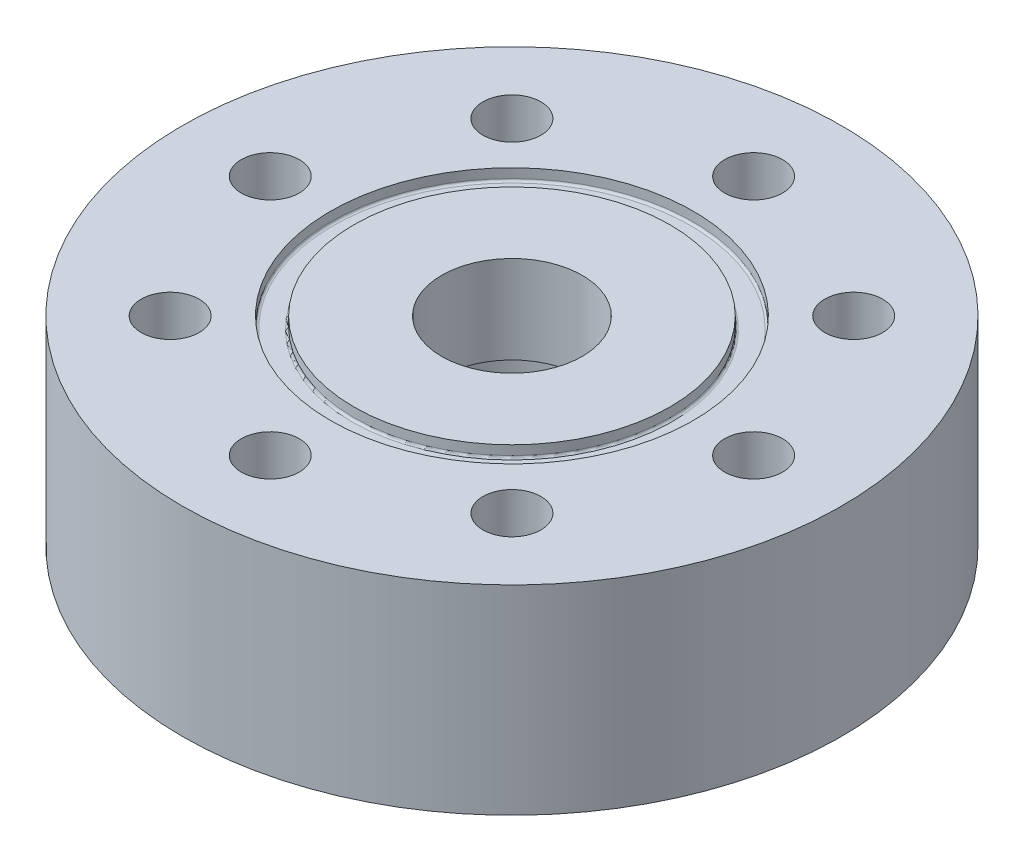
ISO-10303-21;
HEADER;
FILE_DESCRIPTION(('STEP AP214'),'2;1');
FILE_NAME('part.step','',(''),(''),'','','');
FILE_SCHEMA(('AUTOMOTIVE_DESIGN { 1 0 10303 214 1 1 1 1 }'));
ENDSEC;
DATA;
#1=APPLICATION_CONTEXT('core data for automotive mechanical design processes');
#2=APPLICATION_PROTOCOL_DEFINITION('international standard','automotive_design',2000,#1);
#3=PRODUCT_CONTEXT('',#1,'mechanical');
#4=PRODUCT('Part','Part','',(#3));
#5=PRODUCT_RELATED_PRODUCT_CATEGORY('part','',(#4));
#6=PRODUCT_DEFINITION_FORMATION('','',#4);
#7=PRODUCT_DEFINITION_CONTEXT('part definition',#1,'design');
#8=PRODUCT_DEFINITION('design','',#6,#7);
#9=PRODUCT_DEFINITION_SHAPE('','',#8);
#10=(LENGTH_UNIT() NAMED_UNIT(*) SI_UNIT(.MILLI.,.METRE.));
#11=(NAMED_UNIT(*) PLANE_ANGLE_UNIT() SI_UNIT($,.RADIAN.));
#12=(NAMED_UNIT(*) SI_UNIT($,.STERADIAN.) SOLID_ANGLE_UNIT());
#13=UNCERTAINTY_MEASURE_WITH_UNIT(LENGTH_MEASURE(1.E-05),#10,'distance_accuracy_value','');
#14=(GEOMETRIC_REPRESENTATION_CONTEXT(3) GLOBAL_UNCERTAINTY_ASSIGNED_CONTEXT((#13)) GLOBAL_UNIT_ASSIGNED_CONTEXT((#10,
#11,#12)) REPRESENTATION_CONTEXT('',''));
#15=CARTESIAN_POINT('',(0.,0.,0.));
#16=DIRECTION('',(0.,0.,1.));
#17=DIRECTION('',(1.,0.,0.));
#18=AXIS2_PLACEMENT_3D('',#15,#16,#17);
#19=CARTESIAN_POINT('',(0.,22.7,0.));
#20=DIRECTION('',(0.,-1.,0.));
#21=DIRECTION('',(0.,0.,-1.));
#22=AXIS2_PLACEMENT_3D('',#19,#20,#21);
#23=CYLINDRICAL_SURFACE('',#22,37.5);
#24=CARTESIAN_POINT('',(0.,22.7,0.));
#25=DIRECTION('',(0.,1.,0.));
#26=DIRECTION('',(0.,0.,1.));
#27=AXIS2_PLACEMENT_3D('',#24,#25,#26);
#28=CIRCLE('',#27,37.5);
#29=CARTESIAN_POINT('',(0.,22.7,37.5));
#30=VERTEX_POINT('',#29);
#31=EDGE_CURVE('E60',#30,#30,#28,.T.);
#32=ORIENTED_EDGE('',*,*,#31,.F.);
#33=EDGE_LOOP('',(#32));
#34=FACE_BOUND('',#33,.T.);
#35=CARTESIAN_POINT('',(0.,0.,0.));
#36=DIRECTION('',(0.,1.,0.));
#37=DIRECTION('',(0.,0.,1.));
#38=AXIS2_PLACEMENT_3D('',#35,#36,#37);
#39=CIRCLE('',#38,37.5);
#40=CARTESIAN_POINT('',(0.,0.,37.5));
#41=VERTEX_POINT('',#40);
#42=EDGE_CURVE('E61',#41,#41,#39,.T.);
#43=ORIENTED_EDGE('',*,*,#42,.T.);
#44=EDGE_LOOP('',(#43));
#45=FACE_BOUND('',#44,.T.);
#46=ADVANCED_FACE('F36',(#34,#45),#23,.T.);
#47=CARTESIAN_POINT('',(0.,22.7,0.));
#48=DIRECTION('',(0.,1.,0.));
#49=DIRECTION('',(0.,0.,1.));
#50=AXIS2_PLACEMENT_3D('',#47,#48,#49);
#51=PLANE('',#50);
#52=CARTESIAN_POINT('',(0.,22.7,0.));
#53=DIRECTION('',(0.,1.,0.));
#54=DIRECTION('',(0.,0.,1.));
#55=AXIS2_PLACEMENT_3D('',#52,#53,#54);
#56=CIRCLE('',#55,20.6375);
#57=CARTESIAN_POINT('',(0.,22.7,20.6375));
#58=VERTEX_POINT('',#57);
#59=EDGE_CURVE('E82',#58,#58,#56,.T.);
#60=ORIENTED_EDGE('',*,*,#59,.F.);
#61=EDGE_LOOP('',(#60));
#62=FACE_BOUND('',#61,.T.);
#63=CARTESIAN_POINT('',(-27.5,22.7,0.));
#64=DIRECTION('',(0.,-1.,0.));
#65=DIRECTION('',(0.,0.,-1.));
#66=AXIS2_PLACEMENT_3D('',#63,#64,#65);
#67=CIRCLE('',#66,3.3);
#68=CARTESIAN_POINT('',(-27.5,22.7,-3.3));
#69=VERTEX_POINT('',#68);
#70=EDGE_CURVE('E73',#69,#69,#67,.T.);
#71=ORIENTED_EDGE('',*,*,#70,.T.);
#72=EDGE_LOOP('',(#71));
#73=FACE_BOUND('',#72,.T.);
#74=CARTESIAN_POINT('',(-19.44543648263,22.7,19.4454364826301));
#75=DIRECTION('',(0.,-1.,0.));
#76=DIRECTION('',(0.,0.,-1.));
#77=AXIS2_PLACEMENT_3D('',#74,#75,#76);
#78=CIRCLE('',#77,3.30000000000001);
#79=CARTESIAN_POINT('',(-19.44543648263,22.7,16.1454364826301));
#80=VERTEX_POINT('',#79);
#81=EDGE_CURVE('E130',#80,#80,#78,.T.);
#82=ORIENTED_EDGE('',*,*,#81,.T.);
#83=EDGE_LOOP('',(#82));
#84=FACE_BOUND('',#83,.T.);
#85=CARTESIAN_POINT('',(0.,22.7,27.5));
#86=DIRECTION('',(0.,-1.,0.));
#87=DIRECTION('',(0.,0.,-1.));
#88=AXIS2_PLACEMENT_3D('',#85,#86,#87);
#89=CIRCLE('',#88,3.3);
#90=CARTESIAN_POINT('',(0.,22.7,24.2));
#91=VERTEX_POINT('',#90);
#92=EDGE_CURVE('E122',#91,#91,#89,.T.);
#93=ORIENTED_EDGE('',*,*,#92,.T.);
#94=EDGE_LOOP('',(#93));
#95=FACE_BOUND('',#94,.T.);
#96=CARTESIAN_POINT('',(19.4454364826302,22.7,19.44543648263));
#97=DIRECTION('',(0.,-1.,0.));
#98=DIRECTION('',(0.,0.,-1.));
#99=AXIS2_PLACEMENT_3D('',#96,#97,#98);
#100=CIRCLE('',#99,3.3);
#101=CARTESIAN_POINT('',(19.4454364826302,22.7,16.14543648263));
#102=VERTEX_POINT('',#101);
#103=EDGE_CURVE('E114',#102,#102,#100,.T.);
#104=ORIENTED_EDGE('',*,*,#103,.T.);
#105=EDGE_LOOP('',(#104));
#106=FACE_BOUND('',#105,.T.);
#107=CARTESIAN_POINT('',(27.5,22.7,-1.92031473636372E-13));
#108=DIRECTION('',(0.,-1.,0.));
#109=DIRECTION('',(0.,0.,-1.));
#110=AXIS2_PLACEMENT_3D('',#107,#108,#109);
#111=CIRCLE('',#110,3.3);
#112=CARTESIAN_POINT('',(27.5,22.7,-3.30000000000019));
#113=VERTEX_POINT('',#112);
#114=EDGE_CURVE('E106',#113,#113,#111,.T.);
#115=ORIENTED_EDGE('',*,*,#114,.T.);
#116=EDGE_LOOP('',(#115));
#117=FACE_BOUND('',#116,.T.);
#118=CARTESIAN_POINT('',(19.4454364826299,22.7,-19.4454364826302));
#119=DIRECTION('',(0.,-1.,0.));
#120=DIRECTION('',(0.,0.,-1.));
#121=AXIS2_PLACEMENT_3D('',#118,#119,#120);
#122=CIRCLE('',#121,3.3);
#123=CARTESIAN_POINT('',(19.4454364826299,22.7,-22.7454364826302));
#124=VERTEX_POINT('',#123);
#125=EDGE_CURVE('E98',#124,#124,#122,.T.);
#126=ORIENTED_EDGE('',*,*,#125,.T.);
#127=EDGE_LOOP('',(#126));
#128=FACE_BOUND('',#127,.T.);
#129=CARTESIAN_POINT('',(-2.88047210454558E-13,22.7,-27.5));
#130=DIRECTION('',(0.,-1.,0.));
#131=DIRECTION('',(0.,0.,-1.));
#132=AXIS2_PLACEMENT_3D('',#129,#130,#131);
#133=CIRCLE('',#132,3.3);
#134=CARTESIAN_POINT('',(-2.88047210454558E-13,22.7,-30.8));
#135=VERTEX_POINT('',#134);
#136=EDGE_CURVE('E90',#135,#135,#133,.T.);
#137=ORIENTED_EDGE('',*,*,#136,.T.);
#138=EDGE_LOOP('',(#137));
#139=FACE_BOUND('',#138,.T.);
#140=CARTESIAN_POINT('',(-19.4454364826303,22.7,-19.4454364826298));
#141=DIRECTION('',(0.,-1.,0.));
#142=DIRECTION('',(0.,0.,-1.));
#143=AXIS2_PLACEMENT_3D('',#140,#141,#142);
#144=CIRCLE('',#143,3.3);
#145=CARTESIAN_POINT('',(-19.4454364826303,22.7,-22.7454364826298));
#146=VERTEX_POINT('',#145);
#147=EDGE_CURVE('E81',#146,#146,#144,.T.);
#148=ORIENTED_EDGE('',*,*,#147,.T.);
#149=EDGE_LOOP('',(#148));
#150=FACE_BOUND('',#149,.T.);
#151=ORIENTED_EDGE('',*,*,#31,.T.);
#152=EDGE_LOOP('',(#151));
#153=FACE_BOUND('',#152,.T.);
#154=ADVANCED_FACE('F172',(#62,#73,#84,#95,#106,#117,#128,#139,#150,#153),#51,.T.);
#155=CARTESIAN_POINT('',(0.,0.,0.));
#156=DIRECTION('',(0.,1.,0.));
#157=DIRECTION('',(0.,0.,1.));
#158=AXIS2_PLACEMENT_3D('',#155,#156,#157);
#159=PLANE('',#158);
#160=CARTESIAN_POINT('',(-27.5,0.,0.));
#161=DIRECTION('',(0.,-1.,0.));
#162=DIRECTION('',(0.,0.,-1.));
#163=AXIS2_PLACEMENT_3D('',#160,#161,#162);
#164=CIRCLE('',#163,3.3);
#165=CARTESIAN_POINT('',(-27.5,0.,-3.3));
#166=VERTEX_POINT('',#165);
#167=EDGE_CURVE('E134',#166,#166,#164,.T.);
#168=ORIENTED_EDGE('',*,*,#167,.F.);
#169=EDGE_LOOP('',(#168));
#170=FACE_BOUND('',#169,.T.);
#171=CARTESIAN_POINT('',(-19.44543648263,0.,19.4454364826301));
#172=DIRECTION('',(0.,-1.,0.));
#173=DIRECTION('',(0.,0.,-1.));
#174=AXIS2_PLACEMENT_3D('',#171,#172,#173);
#175=CIRCLE('',#174,3.30000000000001);
#176=CARTESIAN_POINT('',(-19.44543648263,0.,16.1454364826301));
#177=VERTEX_POINT('',#176);
#178=EDGE_CURVE('E126',#177,#177,#175,.T.);
#179=ORIENTED_EDGE('',*,*,#178,.F.);
#180=EDGE_LOOP('',(#179));
#181=FACE_BOUND('',#180,.T.);
#182=CARTESIAN_POINT('',(0.,0.,27.5));
#183=DIRECTION('',(0.,-1.,0.));
#184=DIRECTION('',(0.,0.,-1.));
#185=AXIS2_PLACEMENT_3D('',#182,#183,#184);
#186=CIRCLE('',#185,3.3);
#187=CARTESIAN_POINT('',(0.,0.,24.2));
#188=VERTEX_POINT('',#187);
#189=EDGE_CURVE('E118',#188,#188,#186,.T.);
#190=ORIENTED_EDGE('',*,*,#189,.F.);
#191=EDGE_LOOP('',(#190));
#192=FACE_BOUND('',#191,.T.);
#193=CARTESIAN_POINT('',(19.4454364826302,0.,19.44543648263));
#194=DIRECTION('',(0.,-1.,0.));
#195=DIRECTION('',(0.,0.,-1.));
#196=AXIS2_PLACEMENT_3D('',#193,#194,#195);
#197=CIRCLE('',#196,3.3);
#198=CARTESIAN_POINT('',(19.4454364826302,0.,16.14543648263));
#199=VERTEX_POINT('',#198);
#200=EDGE_CURVE('E110',#199,#199,#197,.T.);
#201=ORIENTED_EDGE('',*,*,#200,.F.);
#202=EDGE_LOOP('',(#201));
#203=FACE_BOUND('',#202,.T.);
#204=CARTESIAN_POINT('',(27.5,0.,-1.92031473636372E-13));
#205=DIRECTION('',(0.,-1.,0.));
#206=DIRECTION('',(0.,0.,-1.));
#207=AXIS2_PLACEMENT_3D('',#204,#205,#206);
#208=CIRCLE('',#207,3.3);
#209=CARTESIAN_POINT('',(27.5,0.,-3.30000000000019));
#210=VERTEX_POINT('',#209);
#211=EDGE_CURVE('E102',#210,#210,#208,.T.);
#212=ORIENTED_EDGE('',*,*,#211,.F.);
#213=EDGE_LOOP('',(#212));
#214=FACE_BOUND('',#213,.T.);
#215=CARTESIAN_POINT('',(19.4454364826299,0.,-19.4454364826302));
#216=DIRECTION('',(0.,-1.,0.));
#217=DIRECTION('',(0.,0.,-1.));
#218=AXIS2_PLACEMENT_3D('',#215,#216,#217);
#219=CIRCLE('',#218,3.3);
#220=CARTESIAN_POINT('',(19.4454364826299,0.,-22.7454364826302));
#221=VERTEX_POINT('',#220);
#222=EDGE_CURVE('E94',#221,#221,#219,.T.);
#223=ORIENTED_EDGE('',*,*,#222,.F.);
#224=EDGE_LOOP('',(#223));
#225=FACE_BOUND('',#224,.T.);
#226=CARTESIAN_POINT('',(-2.88047210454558E-13,0.,-27.5));
#227=DIRECTION('',(0.,-1.,0.));
#228=DIRECTION('',(0.,0.,-1.));
#229=AXIS2_PLACEMENT_3D('',#226,#227,#228);
#230=CIRCLE('',#229,3.3);
#231=CARTESIAN_POINT('',(-2.88047210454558E-13,0.,-30.8));
#232=VERTEX_POINT('',#231);
#233=EDGE_CURVE('E86',#232,#232,#230,.T.);
#234=ORIENTED_EDGE('',*,*,#233,.F.);
#235=EDGE_LOOP('',(#234));
#236=FACE_BOUND('',#235,.T.);
#237=CARTESIAN_POINT('',(-19.4454364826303,0.,-19.4454364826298));
#238=DIRECTION('',(0.,-1.,0.));
#239=DIRECTION('',(0.,0.,-1.));
#240=AXIS2_PLACEMENT_3D('',#237,#238,#239);
#241=CIRCLE('',#240,3.3);
#242=CARTESIAN_POINT('',(-19.4454364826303,0.,-22.7454364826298));
#243=VERTEX_POINT('',#242);
#244=EDGE_CURVE('E77',#243,#243,#241,.T.);
#245=ORIENTED_EDGE('',*,*,#244,.F.);
#246=EDGE_LOOP('',(#245));
#247=FACE_BOUND('',#246,.T.);
#248=CARTESIAN_POINT('',(0.,0.,0.));
#249=DIRECTION('',(0.,-1.,0.));
#250=DIRECTION('',(0.,0.,-1.));
#251=AXIS2_PLACEMENT_3D('',#248,#249,#250);
#252=CIRCLE('',#251,8.93);
#253=CARTESIAN_POINT('',(0.,0.,-8.93));
#254=VERTEX_POINT('',#253);
#255=EDGE_CURVE('E69',#254,#254,#252,.T.);
#256=ORIENTED_EDGE('',*,*,#255,.F.);
#257=EDGE_LOOP('',(#256));
#258=FACE_BOUND('',#257,.T.);
#259=ORIENTED_EDGE('',*,*,#42,.F.);
#260=EDGE_LOOP('',(#259));
#261=FACE_BOUND('',#260,.T.);
#262=ADVANCED_FACE('F192',(#170,#181,#192,#203,#214,#225,#236,#247,#258,#261),#159,.F.);
#263=CARTESIAN_POINT('',(0.,12.7,0.));
#264=DIRECTION('',(0.,-1.,0.));
#265=DIRECTION('',(0.,0.,-1.));
#266=AXIS2_PLACEMENT_3D('',#263,#264,#265);
#267=CYLINDRICAL_SURFACE('',#266,8.93);
#268=CARTESIAN_POINT('',(0.,12.7,0.));
#269=DIRECTION('',(0.,-1.,0.));
#270=DIRECTION('',(0.,0.,-1.));
#271=AXIS2_PLACEMENT_3D('',#268,#269,#270);
#272=CIRCLE('',#271,8.93);
#273=CARTESIAN_POINT('',(0.,12.7,-8.93));
#274=VERTEX_POINT('',#273);
#275=EDGE_CURVE('E65',#274,#274,#272,.T.);
#276=ORIENTED_EDGE('',*,*,#275,.F.);
#277=EDGE_LOOP('',(#276));
#278=FACE_BOUND('',#277,.T.);
#279=ORIENTED_EDGE('',*,*,#255,.T.);
#280=EDGE_LOOP('',(#279));
#281=FACE_BOUND('',#280,.T.);
#282=ADVANCED_FACE('F228',(#278,#281),#267,.F.);
#283=CARTESIAN_POINT('',(0.,12.7,0.));
#284=DIRECTION('',(0.,-1.,0.));
#285=DIRECTION('',(0.,0.,-1.));
#286=AXIS2_PLACEMENT_3D('',#283,#284,#285);
#287=PLANE('',#286);
#288=CARTESIAN_POINT('',(0.,12.7,0.));
#289=DIRECTION('',(0.,1.,0.));
#290=DIRECTION('',(0.,0.,1.));
#291=AXIS2_PLACEMENT_3D('',#288,#289,#290);
#292=CIRCLE('',#291,8.);
#293=CARTESIAN_POINT('',(0.,12.7,8.));
#294=VERTEX_POINT('',#293);
#295=EDGE_CURVE('E148',#294,#294,#292,.T.);
#296=ORIENTED_EDGE('',*,*,#295,.T.);
#297=EDGE_LOOP('',(#296));
#298=FACE_BOUND('',#297,.T.);
#299=ORIENTED_EDGE('',*,*,#275,.T.);
#300=EDGE_LOOP('',(#299));
#301=FACE_BOUND('',#300,.T.);
#302=ADVANCED_FACE('F157',(#298,#301),#287,.T.);
#303=CARTESIAN_POINT('',(-19.4454364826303,22.7,-19.4454364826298));
#304=DIRECTION('',(0.,-1.,0.));
#305=DIRECTION('',(0.,0.,-1.));
#306=AXIS2_PLACEMENT_3D('',#303,#304,#305);
#307=CYLINDRICAL_SURFACE('',#306,3.3);
#308=ORIENTED_EDGE('',*,*,#147,.F.);
#309=EDGE_LOOP('',(#308));
#310=FACE_BOUND('',#309,.T.);
#311=ORIENTED_EDGE('',*,*,#244,.T.);
#312=EDGE_LOOP('',(#311));
#313=FACE_BOUND('',#312,.T.);
#314=ADVANCED_FACE('F227',(#310,#313),#307,.F.);
#315=CARTESIAN_POINT('',(-2.88047210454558E-13,22.7,-27.5));
#316=DIRECTION('',(0.,-1.,0.));
#317=DIRECTION('',(0.,0.,-1.));
#318=AXIS2_PLACEMENT_3D('',#315,#316,#317);
#319=CYLINDRICAL_SURFACE('',#318,3.3);
#320=ORIENTED_EDGE('',*,*,#136,.F.);
#321=EDGE_LOOP('',(#320));
#322=FACE_BOUND('',#321,.T.);
#323=ORIENTED_EDGE('',*,*,#233,.T.);
#324=EDGE_LOOP('',(#323));
#325=FACE_BOUND('',#324,.T.);
#326=ADVANCED_FACE('F244',(#322,#325),#319,.F.);
#327=CARTESIAN_POINT('',(19.4454364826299,22.7,-19.4454364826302));
#328=DIRECTION('',(0.,-1.,0.));
#329=DIRECTION('',(0.,0.,-1.));
#330=AXIS2_PLACEMENT_3D('',#327,#328,#329);
#331=CYLINDRICAL_SURFACE('',#330,3.3);
#332=ORIENTED_EDGE('',*,*,#125,.F.);
#333=EDGE_LOOP('',(#332));
#334=FACE_BOUND('',#333,.T.);
#335=ORIENTED_EDGE('',*,*,#222,.T.);
#336=EDGE_LOOP('',(#335));
#337=FACE_BOUND('',#336,.T.);
#338=ADVANCED_FACE('F252',(#334,#337),#331,.F.);
#339=CARTESIAN_POINT('',(27.5,22.7,-1.92031473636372E-13));
#340=DIRECTION('',(0.,-1.,0.));
#341=DIRECTION('',(0.,0.,-1.));
#342=AXIS2_PLACEMENT_3D('',#339,#340,#341);
#343=CYLINDRICAL_SURFACE('',#342,3.3);
#344=ORIENTED_EDGE('',*,*,#114,.F.);
#345=EDGE_LOOP('',(#344));
#346=FACE_BOUND('',#345,.T.);
#347=ORIENTED_EDGE('',*,*,#211,.T.);
#348=EDGE_LOOP('',(#347));
#349=FACE_BOUND('',#348,.T.);
#350=ADVANCED_FACE('F260',(#346,#349),#343,.F.);
#351=CARTESIAN_POINT('',(19.4454364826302,22.7,19.44543648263));
#352=DIRECTION('',(0.,-1.,0.));
#353=DIRECTION('',(0.,0.,-1.));
#354=AXIS2_PLACEMENT_3D('',#351,#352,#353);
#355=CYLINDRICAL_SURFACE('',#354,3.3);
#356=ORIENTED_EDGE('',*,*,#103,.F.);
#357=EDGE_LOOP('',(#356));
#358=FACE_BOUND('',#357,.T.);
#359=ORIENTED_EDGE('',*,*,#200,.T.);
#360=EDGE_LOOP('',(#359));
#361=FACE_BOUND('',#360,.T.);
#362=ADVANCED_FACE('F268',(#358,#361),#355,.F.);
#363=CARTESIAN_POINT('',(0.,22.7,27.5));
#364=DIRECTION('',(0.,-1.,0.));
#365=DIRECTION('',(0.,0.,-1.));
#366=AXIS2_PLACEMENT_3D('',#363,#364,#365);
#367=CYLINDRICAL_SURFACE('',#366,3.3);
#368=ORIENTED_EDGE('',*,*,#92,.F.);
#369=EDGE_LOOP('',(#368));
#370=FACE_BOUND('',#369,.T.);
#371=ORIENTED_EDGE('',*,*,#189,.T.);
#372=EDGE_LOOP('',(#371));
#373=FACE_BOUND('',#372,.T.);
#374=ADVANCED_FACE('F276',(#370,#373),#367,.F.);
#375=CARTESIAN_POINT('',(-19.44543648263,22.7,19.4454364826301));
#376=DIRECTION('',(0.,-1.,0.));
#377=DIRECTION('',(0.,0.,-1.));
#378=AXIS2_PLACEMENT_3D('',#375,#376,#377);
#379=CYLINDRICAL_SURFACE('',#378,3.30000000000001);
#380=ORIENTED_EDGE('',*,*,#81,.F.);
#381=EDGE_LOOP('',(#380));
#382=FACE_BOUND('',#381,.T.);
#383=ORIENTED_EDGE('',*,*,#178,.T.);
#384=EDGE_LOOP('',(#383));
#385=FACE_BOUND('',#384,.T.);
#386=ADVANCED_FACE('F284',(#382,#385),#379,.F.);
#387=CARTESIAN_POINT('',(-27.5,22.7,0.));
#388=DIRECTION('',(0.,-1.,0.));
#389=DIRECTION('',(0.,0.,-1.));
#390=AXIS2_PLACEMENT_3D('',#387,#388,#389);
#391=CYLINDRICAL_SURFACE('',#390,3.3);
#392=ORIENTED_EDGE('',*,*,#70,.F.);
#393=EDGE_LOOP('',(#392));
#394=FACE_BOUND('',#393,.T.);
#395=ORIENTED_EDGE('',*,*,#167,.T.);
#396=EDGE_LOOP('',(#395));
#397=FACE_BOUND('',#396,.T.);
#398=ADVANCED_FACE('F292',(#394,#397),#391,.F.);
#399=CARTESIAN_POINT('',(0.,21.3792,0.));
#400=DIRECTION('',(0.,1.,0.));
#401=DIRECTION('',(0.,0.,1.));
#402=AXIS2_PLACEMENT_3D('',#399,#400,#401);
#403=CYLINDRICAL_SURFACE('',#402,20.6375);
#404=CARTESIAN_POINT('',(0.,21.6332,0.));
#405=DIRECTION('',(0.,1.,0.));
#406=DIRECTION('',(0.,0.,1.));
#407=AXIS2_PLACEMENT_3D('',#404,#405,#406);
#408=CIRCLE('',#407,20.6375);
#409=CARTESIAN_POINT('',(0.,21.6332,20.6375));
#410=VERTEX_POINT('',#409);
#411=EDGE_CURVE('E10',#410,#410,#408,.F.);
#412=ORIENTED_EDGE('',*,*,#411,.T.);
#413=EDGE_LOOP('',(#412));
#414=FACE_BOUND('',#413,.T.);
#415=ORIENTED_EDGE('',*,*,#59,.T.);
#416=EDGE_LOOP('',(#415));
#417=FACE_BOUND('',#416,.T.);
#418=ADVANCED_FACE('F183',(#414,#417),#403,.F.);
#419=CARTESIAN_POINT('',(0.,21.3792,0.));
#420=DIRECTION('',(0.,1.,0.));
#421=DIRECTION('',(0.,0.,1.));
#422=AXIS2_PLACEMENT_3D('',#419,#420,#421);
#423=PLANE('',#422);
#424=CARTESIAN_POINT('',(0.,21.3792,0.));
#425=DIRECTION('',(0.,1.,0.));
#426=DIRECTION('',(0.,0.,1.));
#427=AXIS2_PLACEMENT_3D('',#424,#425,#426);
#428=CIRCLE('',#427,18.2245);
#429=CARTESIAN_POINT('',(0.,21.3792,18.2245));
#430=VERTEX_POINT('',#429);
#431=EDGE_CURVE('E44',#430,#430,#428,.F.);
#432=ORIENTED_EDGE('',*,*,#431,.T.);
#433=EDGE_LOOP('',(#432));
#434=FACE_BOUND('',#433,.T.);
#435=CARTESIAN_POINT('',(0.,21.3792,0.));
#436=DIRECTION('',(0.,1.,0.));
#437=DIRECTION('',(0.,0.,1.));
#438=AXIS2_PLACEMENT_3D('',#435,#436,#437);
#439=CIRCLE('',#438,20.3835);
#440=CARTESIAN_POINT('',(0.,21.3792,20.3835));
#441=VERTEX_POINT('',#440);
#442=EDGE_CURVE('E49',#441,#441,#439,.T.);
#443=ORIENTED_EDGE('',*,*,#442,.T.);
#444=EDGE_LOOP('',(#443));
#445=FACE_BOUND('',#444,.T.);
#446=ADVANCED_FACE('F176',(#434,#445),#423,.T.);
#447=CARTESIAN_POINT('',(0.,21.3792,0.));
#448=DIRECTION('',(0.,1.,0.));
#449=DIRECTION('',(0.,0.,1.));
#450=AXIS2_PLACEMENT_3D('',#447,#448,#449);
#451=CYLINDRICAL_SURFACE('',#450,17.9705);
#452=CARTESIAN_POINT('',(0.,21.6332,0.));
#453=DIRECTION('',(0.,1.,0.));
#454=DIRECTION('',(0.,0.,1.));
#455=AXIS2_PLACEMENT_3D('',#452,#453,#454);
#456=CIRCLE('',#455,17.9705);
#457=CARTESIAN_POINT('',(0.,21.6332,17.9705));
#458=VERTEX_POINT('',#457);
#459=EDGE_CURVE('E54',#458,#458,#456,.T.);
#460=ORIENTED_EDGE('',*,*,#459,.T.);
#461=EDGE_LOOP('',(#460));
#462=FACE_BOUND('',#461,.T.);
#463=CARTESIAN_POINT('',(0.,22.7,0.));
#464=DIRECTION('',(0.,1.,0.));
#465=DIRECTION('',(0.,0.,1.));
#466=AXIS2_PLACEMENT_3D('',#463,#464,#465);
#467=CIRCLE('',#466,17.9705);
#468=CARTESIAN_POINT('',(0.,22.7,17.9705));
#469=VERTEX_POINT('',#468);
#470=EDGE_CURVE('E144',#469,#469,#467,.T.);
#471=ORIENTED_EDGE('',*,*,#470,.F.);
#472=EDGE_LOOP('',(#471));
#473=FACE_BOUND('',#472,.T.);
#474=ADVANCED_FACE('F170',(#462,#473),#451,.T.);
#475=CARTESIAN_POINT('',(0.,22.7,0.));
#476=DIRECTION('',(0.,1.,0.));
#477=DIRECTION('',(0.,0.,1.));
#478=AXIS2_PLACEMENT_3D('',#475,#476,#477);
#479=CIRCLE('',#478,8.);
#480=CARTESIAN_POINT('',(0.,22.7,8.));
#481=VERTEX_POINT('',#480);
#482=EDGE_CURVE('E149',#481,#481,#479,.T.);
#483=ORIENTED_EDGE('',*,*,#482,.F.);
#484=EDGE_LOOP('',(#483));
#485=FACE_BOUND('',#484,.T.);
#486=ORIENTED_EDGE('',*,*,#470,.T.);
#487=EDGE_LOOP('',(#486));
#488=FACE_BOUND('',#487,.T.);
#489=ADVANCED_FACE('F166',(#485,#488),#51,.T.);
#490=CARTESIAN_POINT('',(0.,21.6332,0.));
#491=DIRECTION('',(0.,1.,0.));
#492=DIRECTION('',(0.,0.,1.));
#493=AXIS2_PLACEMENT_3D('',#490,#491,#492);
#494=TOROIDAL_SURFACE('',#493,18.2245,0.254);
#495=ORIENTED_EDGE('',*,*,#431,.F.);
#496=EDGE_LOOP('',(#495));
#497=FACE_BOUND('',#496,.T.);
#498=ORIENTED_EDGE('',*,*,#459,.F.);
#499=EDGE_LOOP('',(#498));
#500=FACE_BOUND('',#499,.T.);
#501=ADVANCED_FACE('F169',(#497,#500),#494,.F.);
#502=CARTESIAN_POINT('',(0.,21.6332,0.));
#503=DIRECTION('',(0.,1.,0.));
#504=DIRECTION('',(0.,0.,1.));
#505=AXIS2_PLACEMENT_3D('',#502,#503,#504);
#506=TOROIDAL_SURFACE('',#505,20.3835,0.254);
#507=ORIENTED_EDGE('',*,*,#411,.F.);
#508=EDGE_LOOP('',(#507));
#509=FACE_BOUND('',#508,.T.);
#510=ORIENTED_EDGE('',*,*,#442,.F.);
#511=EDGE_LOOP('',(#510));
#512=FACE_BOUND('',#511,.T.);
#513=ADVANCED_FACE('F38',(#509,#512),#506,.F.);
#514=CARTESIAN_POINT('',(0.,12.7,0.));
#515=DIRECTION('',(0.,1.,0.));
#516=DIRECTION('',(0.,0.,1.));
#517=AXIS2_PLACEMENT_3D('',#514,#515,#516);
#518=CYLINDRICAL_SURFACE('',#517,8.);
#519=ORIENTED_EDGE('',*,*,#295,.F.);
#520=EDGE_LOOP('',(#519));
#521=FACE_BOUND('',#520,.T.);
#522=ORIENTED_EDGE('',*,*,#482,.T.);
#523=EDGE_LOOP('',(#522));
#524=FACE_BOUND('',#523,.T.);
#525=ADVANCED_FACE('F160',(#521,#524),#518,.F.);
#526=CLOSED_SHELL('',(#46,#154,#262,#282,#302,#314,#326,#338,#350,#362,#374,#386,#398,#418,#446,
#474,#489,#501,#513,#525));
#527=MANIFOLD_SOLID_BREP('B2',#526);
#528=ADVANCED_BREP_SHAPE_REPRESENTATION('',(#18,#527),#14);
#529=SHAPE_DEFINITION_REPRESENTATION(#9,#528);
ENDSEC;
END-ISO-10303-21;
